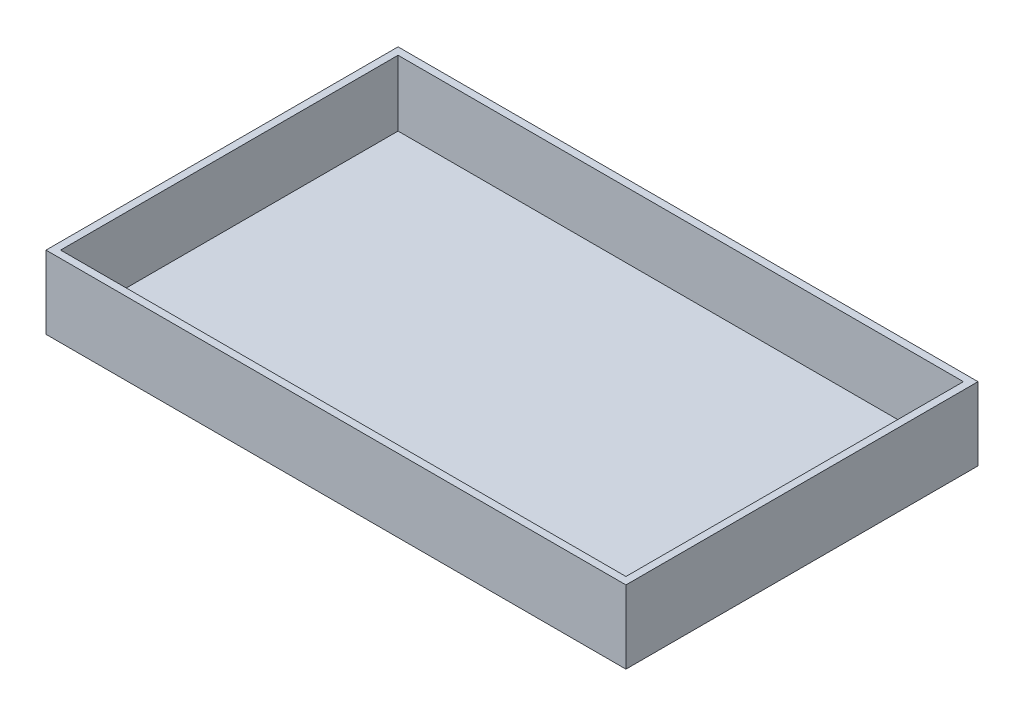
ISO-10303-21;
HEADER;
FILE_DESCRIPTION(('STEP AP214'),'2;1');
FILE_NAME('part.step','',(''),(''),'','','');
FILE_SCHEMA(('AUTOMOTIVE_DESIGN { 1 0 10303 214 1 1 1 1 }'));
ENDSEC;
DATA;
#1=APPLICATION_CONTEXT('core data for automotive mechanical design processes');
#2=APPLICATION_PROTOCOL_DEFINITION('international standard','automotive_design',2000,#1);
#3=PRODUCT_CONTEXT('',#1,'mechanical');
#4=PRODUCT('Part','Part','',(#3));
#5=PRODUCT_RELATED_PRODUCT_CATEGORY('part','',(#4));
#6=PRODUCT_DEFINITION_FORMATION('','',#4);
#7=PRODUCT_DEFINITION_CONTEXT('part definition',#1,'design');
#8=PRODUCT_DEFINITION('design','',#6,#7);
#9=PRODUCT_DEFINITION_SHAPE('','',#8);
#10=(LENGTH_UNIT() NAMED_UNIT(*) SI_UNIT(.MILLI.,.METRE.));
#11=(NAMED_UNIT(*) PLANE_ANGLE_UNIT() SI_UNIT($,.RADIAN.));
#12=(NAMED_UNIT(*) SI_UNIT($,.STERADIAN.) SOLID_ANGLE_UNIT());
#13=UNCERTAINTY_MEASURE_WITH_UNIT(LENGTH_MEASURE(1.E-05),#10,'distance_accuracy_value','');
#14=(GEOMETRIC_REPRESENTATION_CONTEXT(3) GLOBAL_UNCERTAINTY_ASSIGNED_CONTEXT((#13)) GLOBAL_UNIT_ASSIGNED_CONTEXT((#10,
#11,#12)) REPRESENTATION_CONTEXT('',''));
#15=CARTESIAN_POINT('',(0.,0.,0.));
#16=DIRECTION('',(0.,0.,1.));
#17=DIRECTION('',(1.,0.,0.));
#18=AXIS2_PLACEMENT_3D('',#15,#16,#17);
#19=CARTESIAN_POINT('',(-78.3591700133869,20.,-48.4368139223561));
#20=DIRECTION('',(1.,0.,0.));
#21=DIRECTION('',(0.,0.,-1.));
#22=AXIS2_PLACEMENT_3D('',#19,#20,#21);
#23=PLANE('',#22);
#24=DIRECTION('',(0.,0.,1.));
#25=VECTOR('',#24,1.);
#26=CARTESIAN_POINT('',(-78.3591700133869,0.,-48.4368139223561));
#27=LINE('',#26,#25);
#28=CARTESIAN_POINT('',(-78.3591700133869,0.,-48.4368139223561));
#29=VERTEX_POINT('',#28);
#30=CARTESIAN_POINT('',(-78.3591700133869,0.,48.0627844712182));
#31=VERTEX_POINT('',#30);
#32=EDGE_CURVE('E132',#29,#31,#27,.T.);
#33=ORIENTED_EDGE('',*,*,#32,.T.);
#34=DIRECTION('',(0.,-1.,0.));
#35=VECTOR('',#34,1.);
#36=CARTESIAN_POINT('',(-78.3591700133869,20.,48.0627844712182));
#37=LINE('',#36,#35);
#38=CARTESIAN_POINT('',(-78.3591700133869,20.,48.0627844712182));
#39=VERTEX_POINT('',#38);
#40=EDGE_CURVE('E11',#39,#31,#37,.T.);
#41=ORIENTED_EDGE('',*,*,#40,.F.);
#42=DIRECTION('',(0.,0.,1.));
#43=VECTOR('',#42,1.);
#44=CARTESIAN_POINT('',(-78.3591700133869,20.,-48.4368139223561));
#45=LINE('',#44,#43);
#46=CARTESIAN_POINT('',(-78.3591700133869,20.,-48.4368139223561));
#47=VERTEX_POINT('',#46);
#48=EDGE_CURVE('E141',#47,#39,#45,.T.);
#49=ORIENTED_EDGE('',*,*,#48,.F.);
#50=DIRECTION('',(0.,-1.,0.));
#51=VECTOR('',#50,1.);
#52=CARTESIAN_POINT('',(-78.3591700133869,20.,-48.4368139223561));
#53=LINE('',#52,#51);
#54=EDGE_CURVE('E148',#47,#29,#53,.T.);
#55=ORIENTED_EDGE('',*,*,#54,.T.);
#56=EDGE_LOOP('',(#33,#41,#49,#55));
#57=FACE_BOUND('',#56,.T.);
#58=ADVANCED_FACE('F33',(#57),#23,.F.);
#59=CARTESIAN_POINT('',(-78.3591700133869,20.,48.0627844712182));
#60=DIRECTION('',(0.,0.,-1.));
#61=DIRECTION('',(-1.,0.,0.));
#62=AXIS2_PLACEMENT_3D('',#59,#60,#61);
#63=PLANE('',#62);
#64=DIRECTION('',(1.,0.,0.));
#65=VECTOR('',#64,1.);
#66=CARTESIAN_POINT('',(-78.3591700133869,0.,48.0627844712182));
#67=LINE('',#66,#65);
#68=CARTESIAN_POINT('',(80.6033467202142,0.,48.0627844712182));
#69=VERTEX_POINT('',#68);
#70=EDGE_CURVE('E135',#31,#69,#67,.T.);
#71=ORIENTED_EDGE('',*,*,#70,.T.);
#72=DIRECTION('',(0.,-1.,0.));
#73=VECTOR('',#72,1.);
#74=CARTESIAN_POINT('',(80.6033467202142,20.,48.0627844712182));
#75=LINE('',#74,#73);
#76=CARTESIAN_POINT('',(80.6033467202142,20.,48.0627844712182));
#77=VERTEX_POINT('',#76);
#78=EDGE_CURVE('E40',#77,#69,#75,.T.);
#79=ORIENTED_EDGE('',*,*,#78,.F.);
#80=DIRECTION('',(1.,0.,0.));
#81=VECTOR('',#80,1.);
#82=CARTESIAN_POINT('',(-78.3591700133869,20.,48.0627844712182));
#83=LINE('',#82,#81);
#84=EDGE_CURVE('E143',#39,#77,#83,.T.);
#85=ORIENTED_EDGE('',*,*,#84,.F.);
#86=ORIENTED_EDGE('',*,*,#40,.T.);
#87=EDGE_LOOP('',(#71,#79,#85,#86));
#88=FACE_BOUND('',#87,.T.);
#89=ADVANCED_FACE('F171',(#88),#63,.F.);
#90=CARTESIAN_POINT('',(80.6033467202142,20.,-48.4368139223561));
#91=DIRECTION('',(-1.,0.,0.));
#92=DIRECTION('',(0.,0.,1.));
#93=AXIS2_PLACEMENT_3D('',#90,#91,#92);
#94=PLANE('',#93);
#95=DIRECTION('',(0.,0.,-1.));
#96=VECTOR('',#95,1.);
#97=CARTESIAN_POINT('',(80.6033467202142,0.,-48.4368139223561));
#98=LINE('',#97,#96);
#99=CARTESIAN_POINT('',(80.6033467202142,0.,-48.4368139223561));
#100=VERTEX_POINT('',#99);
#101=EDGE_CURVE('E137',#69,#100,#98,.T.);
#102=ORIENTED_EDGE('',*,*,#101,.T.);
#103=DIRECTION('',(0.,-1.,0.));
#104=VECTOR('',#103,1.);
#105=CARTESIAN_POINT('',(80.6033467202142,20.,-48.4368139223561));
#106=LINE('',#105,#104);
#107=CARTESIAN_POINT('',(80.6033467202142,20.,-48.4368139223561));
#108=VERTEX_POINT('',#107);
#109=EDGE_CURVE('E151',#108,#100,#106,.T.);
#110=ORIENTED_EDGE('',*,*,#109,.F.);
#111=DIRECTION('',(0.,0.,-1.));
#112=VECTOR('',#111,1.);
#113=CARTESIAN_POINT('',(80.6033467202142,20.,-48.4368139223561));
#114=LINE('',#113,#112);
#115=EDGE_CURVE('E145',#77,#108,#114,.T.);
#116=ORIENTED_EDGE('',*,*,#115,.F.);
#117=ORIENTED_EDGE('',*,*,#78,.T.);
#118=EDGE_LOOP('',(#102,#110,#116,#117));
#119=FACE_BOUND('',#118,.T.);
#120=ADVANCED_FACE('F158',(#119),#94,.F.);
#121=CARTESIAN_POINT('',(-78.3591700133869,20.,-48.4368139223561));
#122=DIRECTION('',(0.,0.,1.));
#123=DIRECTION('',(1.,0.,0.));
#124=AXIS2_PLACEMENT_3D('',#121,#122,#123);
#125=PLANE('',#124);
#126=DIRECTION('',(-1.,0.,0.));
#127=VECTOR('',#126,1.);
#128=CARTESIAN_POINT('',(-78.3591700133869,0.,-48.4368139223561));
#129=LINE('',#128,#127);
#130=EDGE_CURVE('E139',#100,#29,#129,.T.);
#131=ORIENTED_EDGE('',*,*,#130,.T.);
#132=ORIENTED_EDGE('',*,*,#54,.F.);
#133=DIRECTION('',(-1.,0.,0.));
#134=VECTOR('',#133,1.);
#135=CARTESIAN_POINT('',(-78.3591700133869,20.,-48.4368139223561));
#136=LINE('',#135,#134);
#137=EDGE_CURVE('E55',#108,#47,#136,.T.);
#138=ORIENTED_EDGE('',*,*,#137,.F.);
#139=ORIENTED_EDGE('',*,*,#109,.T.);
#140=EDGE_LOOP('',(#131,#132,#138,#139));
#141=FACE_BOUND('',#140,.T.);
#142=ADVANCED_FACE('F166',(#141),#125,.F.);
#143=CARTESIAN_POINT('',(-78.3591700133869,20.,48.0627844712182));
#144=DIRECTION('',(0.,1.,0.));
#145=DIRECTION('',(0.,0.,1.));
#146=AXIS2_PLACEMENT_3D('',#143,#144,#145);
#147=PLANE('',#146);
#148=DIRECTION('',(0.,0.,1.));
#149=VECTOR('',#148,1.);
#150=CARTESIAN_POINT('',(-76.3591700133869,20.,-48.4368139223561));
#151=LINE('',#150,#149);
#152=CARTESIAN_POINT('',(-76.3591700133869,20.,-46.4368139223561));
#153=VERTEX_POINT('',#152);
#154=CARTESIAN_POINT('',(-76.3591700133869,20.,46.0627844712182));
#155=VERTEX_POINT('',#154);
#156=EDGE_CURVE('E121',#153,#155,#151,.T.);
#157=ORIENTED_EDGE('',*,*,#156,.F.);
#158=DIRECTION('',(-1.,0.,0.));
#159=VECTOR('',#158,1.);
#160=CARTESIAN_POINT('',(-78.3591700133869,20.,-46.4368139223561));
#161=LINE('',#160,#159);
#162=CARTESIAN_POINT('',(78.6033467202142,20.,-46.4368139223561));
#163=VERTEX_POINT('',#162);
#164=EDGE_CURVE('E130',#163,#153,#161,.T.);
#165=ORIENTED_EDGE('',*,*,#164,.F.);
#166=DIRECTION('',(0.,0.,-1.));
#167=VECTOR('',#166,1.);
#168=CARTESIAN_POINT('',(78.6033467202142,20.,-48.4368139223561));
#169=LINE('',#168,#167);
#170=CARTESIAN_POINT('',(78.6033467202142,20.,46.0627844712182));
#171=VERTEX_POINT('',#170);
#172=EDGE_CURVE('E128',#171,#163,#169,.T.);
#173=ORIENTED_EDGE('',*,*,#172,.F.);
#174=DIRECTION('',(1.,0.,0.));
#175=VECTOR('',#174,1.);
#176=CARTESIAN_POINT('',(-78.3591700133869,20.,46.0627844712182));
#177=LINE('',#176,#175);
#178=EDGE_CURVE('E113',#155,#171,#177,.T.);
#179=ORIENTED_EDGE('',*,*,#178,.F.);
#180=EDGE_LOOP('',(#157,#165,#173,#179));
#181=FACE_BOUND('',#180,.T.);
#182=ORIENTED_EDGE('',*,*,#48,.T.);
#183=ORIENTED_EDGE('',*,*,#84,.T.);
#184=ORIENTED_EDGE('',*,*,#115,.T.);
#185=ORIENTED_EDGE('',*,*,#137,.T.);
#186=EDGE_LOOP('',(#182,#183,#184,#185));
#187=FACE_BOUND('',#186,.T.);
#188=ADVANCED_FACE('F170',(#181,#187),#147,.T.);
#189=CARTESIAN_POINT('',(-78.3591700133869,0.,48.0627844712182));
#190=DIRECTION('',(0.,1.,0.));
#191=DIRECTION('',(0.,0.,1.));
#192=AXIS2_PLACEMENT_3D('',#189,#190,#191);
#193=PLANE('',#192);
#194=ORIENTED_EDGE('',*,*,#32,.F.);
#195=ORIENTED_EDGE('',*,*,#130,.F.);
#196=ORIENTED_EDGE('',*,*,#101,.F.);
#197=ORIENTED_EDGE('',*,*,#70,.F.);
#198=EDGE_LOOP('',(#194,#195,#196,#197));
#199=FACE_BOUND('',#198,.T.);
#200=ADVANCED_FACE('F164',(#199),#193,.F.);
#201=CARTESIAN_POINT('',(-76.3591700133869,20.,-48.4368139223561));
#202=DIRECTION('',(1.,0.,0.));
#203=DIRECTION('',(0.,0.,-1.));
#204=AXIS2_PLACEMENT_3D('',#201,#202,#203);
#205=PLANE('',#204);
#206=DIRECTION('',(0.,0.,1.));
#207=VECTOR('',#206,1.);
#208=CARTESIAN_POINT('',(-76.3591700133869,2.,-48.4368139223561));
#209=LINE('',#208,#207);
#210=CARTESIAN_POINT('',(-76.3591700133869,2.,-46.4368139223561));
#211=VERTEX_POINT('',#210);
#212=CARTESIAN_POINT('',(-76.3591700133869,2.,46.0627844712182));
#213=VERTEX_POINT('',#212);
#214=EDGE_CURVE('E104',#211,#213,#209,.T.);
#215=ORIENTED_EDGE('',*,*,#214,.F.);
#216=DIRECTION('',(0.,-1.,0.));
#217=VECTOR('',#216,1.);
#218=CARTESIAN_POINT('',(-76.3591700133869,20.,-46.4368139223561));
#219=LINE('',#218,#217);
#220=EDGE_CURVE('E124',#153,#211,#219,.T.);
#221=ORIENTED_EDGE('',*,*,#220,.F.);
#222=ORIENTED_EDGE('',*,*,#156,.T.);
#223=DIRECTION('',(0.,-1.,0.));
#224=VECTOR('',#223,1.);
#225=CARTESIAN_POINT('',(-76.3591700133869,20.,46.0627844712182));
#226=LINE('',#225,#224);
#227=EDGE_CURVE('E116',#155,#213,#226,.T.);
#228=ORIENTED_EDGE('',*,*,#227,.T.);
#229=EDGE_LOOP('',(#215,#221,#222,#228));
#230=FACE_BOUND('',#229,.T.);
#231=ADVANCED_FACE('F186',(#230),#205,.T.);
#232=CARTESIAN_POINT('',(-78.3591700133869,20.,46.0627844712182));
#233=DIRECTION('',(0.,0.,-1.));
#234=DIRECTION('',(-1.,0.,0.));
#235=AXIS2_PLACEMENT_3D('',#232,#233,#234);
#236=PLANE('',#235);
#237=DIRECTION('',(1.,0.,0.));
#238=VECTOR('',#237,1.);
#239=CARTESIAN_POINT('',(-78.3591700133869,2.,46.0627844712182));
#240=LINE('',#239,#238);
#241=CARTESIAN_POINT('',(78.6033467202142,2.,46.0627844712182));
#242=VERTEX_POINT('',#241);
#243=EDGE_CURVE('E98',#213,#242,#240,.T.);
#244=ORIENTED_EDGE('',*,*,#243,.F.);
#245=ORIENTED_EDGE('',*,*,#227,.F.);
#246=ORIENTED_EDGE('',*,*,#178,.T.);
#247=DIRECTION('',(0.,-1.,0.));
#248=VECTOR('',#247,1.);
#249=CARTESIAN_POINT('',(78.6033467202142,20.,46.0627844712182));
#250=LINE('',#249,#248);
#251=EDGE_CURVE('E110',#171,#242,#250,.T.);
#252=ORIENTED_EDGE('',*,*,#251,.T.);
#253=EDGE_LOOP('',(#244,#245,#246,#252));
#254=FACE_BOUND('',#253,.T.);
#255=ADVANCED_FACE('F111',(#254),#236,.T.);
#256=CARTESIAN_POINT('',(78.6033467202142,20.,-48.4368139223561));
#257=DIRECTION('',(-1.,0.,0.));
#258=DIRECTION('',(0.,0.,1.));
#259=AXIS2_PLACEMENT_3D('',#256,#257,#258);
#260=PLANE('',#259);
#261=DIRECTION('',(0.,0.,-1.));
#262=VECTOR('',#261,1.);
#263=CARTESIAN_POINT('',(78.6033467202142,2.,-48.4368139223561));
#264=LINE('',#263,#262);
#265=CARTESIAN_POINT('',(78.6033467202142,2.,-46.4368139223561));
#266=VERTEX_POINT('',#265);
#267=EDGE_CURVE('E102',#242,#266,#264,.T.);
#268=ORIENTED_EDGE('',*,*,#267,.F.);
#269=ORIENTED_EDGE('',*,*,#251,.F.);
#270=ORIENTED_EDGE('',*,*,#172,.T.);
#271=DIRECTION('',(0.,-1.,0.));
#272=VECTOR('',#271,1.);
#273=CARTESIAN_POINT('',(78.6033467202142,20.,-46.4368139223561));
#274=LINE('',#273,#272);
#275=EDGE_CURVE('E47',#163,#266,#274,.T.);
#276=ORIENTED_EDGE('',*,*,#275,.T.);
#277=EDGE_LOOP('',(#268,#269,#270,#276));
#278=FACE_BOUND('',#277,.T.);
#279=ADVANCED_FACE('F118',(#278),#260,.T.);
#280=CARTESIAN_POINT('',(-78.3591700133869,20.,-46.4368139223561));
#281=DIRECTION('',(0.,0.,1.));
#282=DIRECTION('',(1.,0.,0.));
#283=AXIS2_PLACEMENT_3D('',#280,#281,#282);
#284=PLANE('',#283);
#285=DIRECTION('',(-1.,0.,0.));
#286=VECTOR('',#285,1.);
#287=CARTESIAN_POINT('',(-78.3591700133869,2.,-46.4368139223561));
#288=LINE('',#287,#286);
#289=EDGE_CURVE('E119',#266,#211,#288,.T.);
#290=ORIENTED_EDGE('',*,*,#289,.F.);
#291=ORIENTED_EDGE('',*,*,#275,.F.);
#292=ORIENTED_EDGE('',*,*,#164,.T.);
#293=ORIENTED_EDGE('',*,*,#220,.T.);
#294=EDGE_LOOP('',(#290,#291,#292,#293));
#295=FACE_BOUND('',#294,.T.);
#296=ADVANCED_FACE('F189',(#295),#284,.T.);
#297=CARTESIAN_POINT('',(-78.3591700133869,2.,48.0627844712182));
#298=DIRECTION('',(0.,1.,0.));
#299=DIRECTION('',(0.,0.,1.));
#300=AXIS2_PLACEMENT_3D('',#297,#298,#299);
#301=PLANE('',#300);
#302=ORIENTED_EDGE('',*,*,#214,.T.);
#303=ORIENTED_EDGE('',*,*,#243,.T.);
#304=ORIENTED_EDGE('',*,*,#267,.T.);
#305=ORIENTED_EDGE('',*,*,#289,.T.);
#306=EDGE_LOOP('',(#302,#303,#304,#305));
#307=FACE_BOUND('',#306,.T.);
#308=ADVANCED_FACE('F100',(#307),#301,.T.);
#309=CLOSED_SHELL('',(#58,#89,#120,#142,#188,#200,#231,#255,#279,#296,#308));
#310=MANIFOLD_SOLID_BREP('B2',#309);
#311=ADVANCED_BREP_SHAPE_REPRESENTATION('',(#18,#310),#14);
#312=SHAPE_DEFINITION_REPRESENTATION(#9,#311);
ENDSEC;
END-ISO-10303-21;
